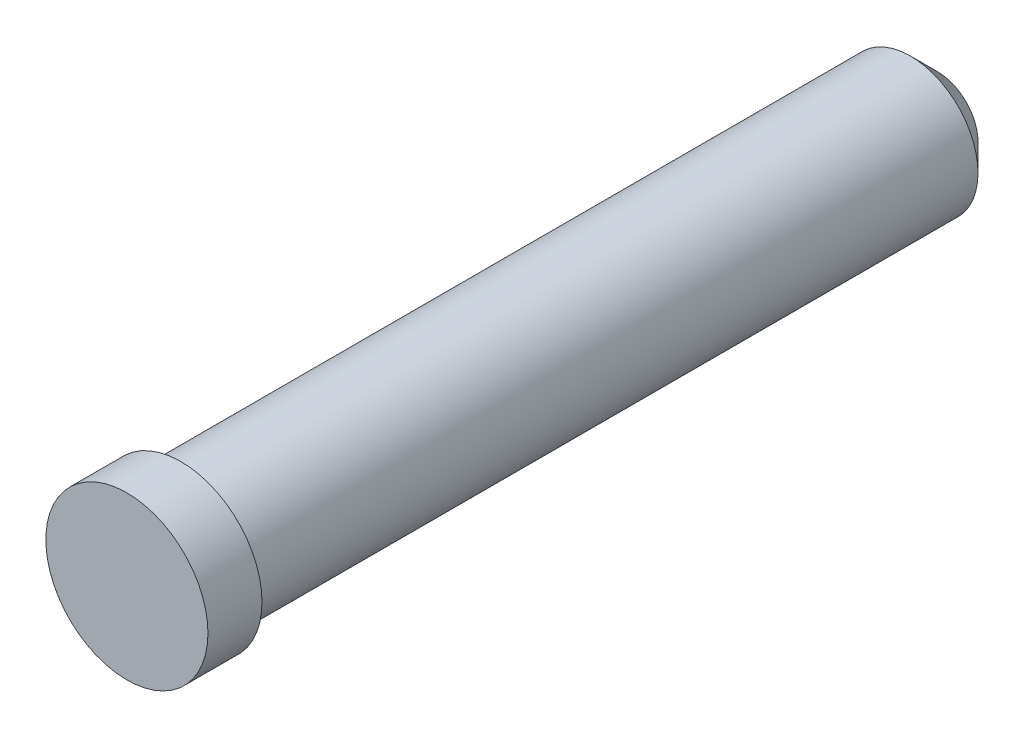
from build123d import *

# Parameters (mm, degrees)
ESQUISSE1_R          = 2.5
BASE_EXTRUSION_DEPTH = 28
ESQUISSE2_R          = 3
BOSS_EXTRU_1_DEPTH   = 2
CHANFREIN1_SIZE      = 1


with BuildPart() as part:
    # Esquisse1 → Base-Extrusion (new body)
    with BuildSketch(Plane.XY):
        Circle(ESQUISSE1_R)
    extrude(amount=BASE_EXTRUSION_DEPTH)

    # Esquisse2 → Boss.-Extru.1 (add)
    with BuildSketch(Plane.XY.offset(28)):
        Circle(ESQUISSE2_R)
    extrude(amount=BOSS_EXTRU_1_DEPTH)

    # Chanfrein1
    chanfrein1_edges = [part.edges().sort_by_distance(p)[0] for p in [
        (-2.5, 0, 0),
    ]]
    chamfer(chanfrein1_edges, length=CHANFREIN1_SIZE)


solid = part.part
